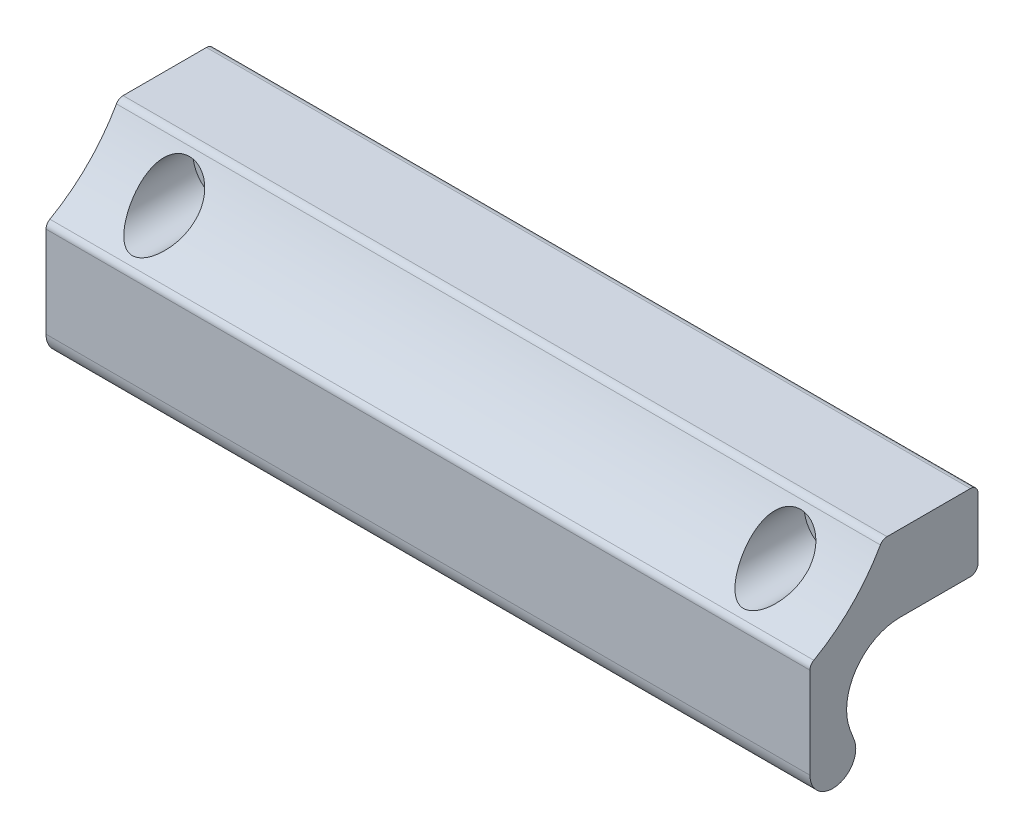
ISO-10303-21;
HEADER;
FILE_DESCRIPTION(('STEP AP214'),'2;1');
FILE_NAME('part.step','',(''),(''),'','','');
FILE_SCHEMA(('AUTOMOTIVE_DESIGN { 1 0 10303 214 1 1 1 1 }'));
ENDSEC;
DATA;
#1=APPLICATION_CONTEXT('core data for automotive mechanical design processes');
#2=APPLICATION_PROTOCOL_DEFINITION('international standard','automotive_design',2000,#1);
#3=PRODUCT_CONTEXT('',#1,'mechanical');
#4=PRODUCT('Part','Part','',(#3));
#5=PRODUCT_RELATED_PRODUCT_CATEGORY('part','',(#4));
#6=PRODUCT_DEFINITION_FORMATION('','',#4);
#7=PRODUCT_DEFINITION_CONTEXT('part definition',#1,'design');
#8=PRODUCT_DEFINITION('design','',#6,#7);
#9=PRODUCT_DEFINITION_SHAPE('','',#8);
#10=(LENGTH_UNIT() NAMED_UNIT(*) SI_UNIT(.MILLI.,.METRE.));
#11=(NAMED_UNIT(*) PLANE_ANGLE_UNIT() SI_UNIT($,.RADIAN.));
#12=(NAMED_UNIT(*) SI_UNIT($,.STERADIAN.) SOLID_ANGLE_UNIT());
#13=UNCERTAINTY_MEASURE_WITH_UNIT(LENGTH_MEASURE(1.E-05),#10,'distance_accuracy_value','');
#14=(GEOMETRIC_REPRESENTATION_CONTEXT(3) GLOBAL_UNCERTAINTY_ASSIGNED_CONTEXT((#13)) GLOBAL_UNIT_ASSIGNED_CONTEXT((#10,
#11,#12)) REPRESENTATION_CONTEXT('',''));
#15=CARTESIAN_POINT('',(0.,0.,0.));
#16=DIRECTION('',(0.,0.,1.));
#17=DIRECTION('',(1.,0.,0.));
#18=AXIS2_PLACEMENT_3D('',#15,#16,#17);
#19=CARTESIAN_POINT('',(-10.,15.8043402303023,32.8043402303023));
#20=DIRECTION('',(1.,0.,0.));
#21=DIRECTION('',(0.,1.,0.));
#22=AXIS2_PLACEMENT_3D('',#19,#20,#21);
#23=CYLINDRICAL_SURFACE('',#22,23.);
#24=CARTESIAN_POINT('',(83.75,0.,16.094378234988));
#25=CARTESIAN_POINT('',(83.7500006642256,-0.150169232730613,16.236409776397));
#26=CARTESIAN_POINT('',(83.7409857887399,-0.29845859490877,16.3805076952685));
#27=CARTESIAN_POINT('',(83.7061827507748,-0.590181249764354,16.6716960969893));
#28=CARTESIAN_POINT('',(83.6803814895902,-0.733610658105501,16.8187888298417));
#29=CARTESIAN_POINT('',(83.6128217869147,-1.01544237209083,17.1155863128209));
#30=CARTESIAN_POINT('',(83.5709823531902,-1.15381519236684,17.2653005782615));
#31=CARTESIAN_POINT('',(83.4720695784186,-1.42405592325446,17.5654707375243));
#32=CARTESIAN_POINT('',(83.4150003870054,-1.55592559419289,17.7159264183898));
#33=CARTESIAN_POINT('',(83.2849647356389,-1.81460439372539,18.0187712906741));
#34=CARTESIAN_POINT('',(83.2117670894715,-1.9413043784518,18.1711545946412));
#35=CARTESIAN_POINT('',(83.0498715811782,-2.1868769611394,18.4741574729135));
#36=CARTESIAN_POINT('',(82.9611662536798,-2.30574575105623,18.6247761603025));
#37=CARTESIAN_POINT('',(82.7681376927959,-2.53420019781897,18.9215160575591));
#38=CARTESIAN_POINT('',(82.6638971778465,-2.64383047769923,19.067656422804));
#39=CARTESIAN_POINT('',(82.4382918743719,-2.853229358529,19.3534526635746));
#40=CARTESIAN_POINT('',(82.316948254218,-2.95300989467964,19.493116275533));
#41=CARTESIAN_POINT('',(82.0789502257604,-3.12374564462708,19.7373761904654));
#42=CARTESIAN_POINT('',(81.965498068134,-3.19663498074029,19.8437139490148));
#43=CARTESIAN_POINT('',(81.7241156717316,-3.33304729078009,20.045999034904));
#44=CARTESIAN_POINT('',(81.5961684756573,-3.39655909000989,20.1419339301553));
#45=CARTESIAN_POINT('',(81.3222714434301,-3.51232726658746,20.3192407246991));
#46=CARTESIAN_POINT('',(81.1760841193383,-3.56440400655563,20.4003772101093));
#47=CARTESIAN_POINT('',(80.9451529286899,-3.62981593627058,20.5033135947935));
#48=CARTESIAN_POINT('',(80.8663403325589,-3.64948596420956,20.5344702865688));
#49=CARTESIAN_POINT('',(80.7051956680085,-3.68401760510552,20.5893923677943));
#50=CARTESIAN_POINT('',(80.6228662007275,-3.69888270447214,20.6131631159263));
#51=CARTESIAN_POINT('',(80.4293848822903,-3.72697994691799,20.658210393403));
#52=CARTESIAN_POINT('',(80.3172035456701,-3.73828046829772,20.6764343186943));
#53=CARTESIAN_POINT('',(80.0908651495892,-3.75060996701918,20.6963234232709));
#54=CARTESIAN_POINT('',(79.9767093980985,-3.75164550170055,20.6979991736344));
#55=CARTESIAN_POINT('',(79.7498794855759,-3.74336926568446,20.6846411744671));
#56=CARTESIAN_POINT('',(79.6372042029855,-3.73406584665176,20.669620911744));
#57=CARTESIAN_POINT('',(79.4161596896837,-3.70595298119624,20.6244737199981));
#58=CARTESIAN_POINT('',(79.307794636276,-3.68713454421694,20.5943325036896));
#59=CARTESIAN_POINT('',(79.0562251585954,-3.6323825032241,20.5072938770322));
#60=CARTESIAN_POINT('',(78.9158969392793,-3.59263719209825,20.4445472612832));
#61=CARTESIAN_POINT('',(78.6486494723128,-3.50092089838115,20.3017774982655));
#62=CARTESIAN_POINT('',(78.5217650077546,-3.44891927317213,20.2217110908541));
#63=CARTESIAN_POINT('',(78.303724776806,-3.34616134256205,20.0659999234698));
#64=CARTESIAN_POINT('',(78.2103375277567,-3.29701024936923,19.9923557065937));
#65=CARTESIAN_POINT('',(78.0314834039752,-3.19345122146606,19.839292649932));
#66=CARTESIAN_POINT('',(77.946021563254,-3.13903998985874,19.7598701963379));
#67=CARTESIAN_POINT('',(77.7823320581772,-3.0256203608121,19.5966727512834));
#68=CARTESIAN_POINT('',(77.704116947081,-2.96660430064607,19.5128905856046));
#69=CARTESIAN_POINT('',(77.554530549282,-2.84455534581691,19.3421814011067));
#70=CARTESIAN_POINT('',(77.4831614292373,-2.7815211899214,19.255253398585));
#71=CARTESIAN_POINT('',(77.3069800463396,-2.61388606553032,19.0275868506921));
#72=CARTESIAN_POINT('',(77.2070155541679,-2.50653247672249,18.8851063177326));
#73=CARTESIAN_POINT('',(77.022064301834,-2.28371602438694,18.5967547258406));
#74=CARTESIAN_POINT('',(76.9370856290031,-2.16824882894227,18.4508818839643));
#75=CARTESIAN_POINT('',(76.7815301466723,-1.92982538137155,18.1573214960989));
#76=CARTESIAN_POINT('',(76.710967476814,-1.80686192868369,18.0096323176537));
#77=CARTESIAN_POINT('',(76.5842889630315,-1.55415187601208,17.7139267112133));
#78=CARTESIAN_POINT('',(76.5281703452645,-1.42440658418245,17.565910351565));
#79=CARTESIAN_POINT('',(76.4294697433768,-1.15535678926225,17.2669625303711));
#80=CARTESIAN_POINT('',(76.3872582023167,-1.01589497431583,17.116049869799));
#81=CARTESIAN_POINT('',(76.3190319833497,-0.731044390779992,16.8160994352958));
#82=CARTESIAN_POINT('',(76.293019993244,-0.585654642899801,16.667061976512));
#83=CARTESIAN_POINT('',(76.25828003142,-0.290055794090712,16.3722410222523));
#84=CARTESIAN_POINT('',(76.2495221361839,-0.139855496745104,16.2264523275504));
#85=CARTESIAN_POINT('',(76.2505179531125,0.164377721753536,15.9391279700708));
#86=CARTESIAN_POINT('',(76.2602636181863,0.318408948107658,15.7975904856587));
#87=CARTESIAN_POINT('',(76.3079126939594,0.692581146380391,15.4630412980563));
#88=CARTESIAN_POINT('',(76.3557102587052,0.913971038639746,15.2726783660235));
#89=CARTESIAN_POINT('',(76.495799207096,1.35518812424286,14.9073062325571));
#90=CARTESIAN_POINT('',(76.588026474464,1.57501710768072,14.7322753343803));
#91=CARTESIAN_POINT('',(76.7991197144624,1.9636736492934,14.4335970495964));
#92=CARTESIAN_POINT('',(76.909662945,2.13429131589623,14.3064889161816));
#93=CARTESIAN_POINT('',(77.1001727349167,2.37997450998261,14.1282393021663));
#94=CARTESIAN_POINT('',(77.1678322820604,2.46019965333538,14.0708656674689));
#95=CARTESIAN_POINT('',(77.3113580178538,2.616281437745,13.9606622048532));
#96=CARTESIAN_POINT('',(77.3872204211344,2.69214006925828,13.907830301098));
#97=CARTESIAN_POINT('',(77.5477452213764,2.83917333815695,13.806643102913));
#98=CARTESIAN_POINT('',(77.6324832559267,2.91029755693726,13.758334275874));
#99=CARTESIAN_POINT('',(77.8097619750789,3.04594886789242,13.6672003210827));
#100=CARTESIAN_POINT('',(77.902298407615,3.11047951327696,13.6243722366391));
#101=CARTESIAN_POINT('',(78.0946077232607,3.23185755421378,13.5445905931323));
#102=CARTESIAN_POINT('',(78.1943773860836,3.2887083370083,13.5076344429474));
#103=CARTESIAN_POINT('',(78.4004020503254,3.39369189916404,13.4399472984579));
#104=CARTESIAN_POINT('',(78.5066557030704,3.44182648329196,13.4092150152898));
#105=CARTESIAN_POINT('',(78.7083226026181,3.52193401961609,13.3584049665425));
#106=CARTESIAN_POINT('',(78.8029778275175,3.55524764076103,13.3374209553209));
#107=CARTESIAN_POINT('',(78.9955300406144,3.61437106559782,13.3003439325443));
#108=CARTESIAN_POINT('',(79.0934265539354,3.64018196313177,13.2842502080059));
#109=CARTESIAN_POINT('',(79.2915997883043,3.68387839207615,13.2570880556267));
#110=CARTESIAN_POINT('',(79.3918751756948,3.70176825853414,13.2460168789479));
#111=CARTESIAN_POINT('',(79.5939747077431,3.72934871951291,13.2289770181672));
#112=CARTESIAN_POINT('',(79.6957987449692,3.73903988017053,13.2230079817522));
#113=CARTESIAN_POINT('',(79.8896006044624,3.74949905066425,13.2165676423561));
#114=CARTESIAN_POINT('',(79.9815192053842,3.751079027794,13.2155960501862));
#115=CARTESIAN_POINT('',(80.1652063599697,3.7474856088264,13.2178075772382));
#116=CARTESIAN_POINT('',(80.2569748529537,3.74230994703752,13.2209920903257));
#117=CARTESIAN_POINT('',(80.4395972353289,3.72527248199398,13.2314961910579));
#118=CARTESIAN_POINT('',(80.5304516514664,3.71341478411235,13.2388132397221));
#119=CARTESIAN_POINT('',(80.7106535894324,3.68318293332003,13.2575283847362));
#120=CARTESIAN_POINT('',(80.8000005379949,3.66480635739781,13.2689279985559));
#121=CARTESIAN_POINT('',(81.0615737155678,3.60101108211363,13.3086664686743));
#122=CARTESIAN_POINT('',(81.2308516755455,3.54658365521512,13.3427515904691));
#123=CARTESIAN_POINT('',(81.5568664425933,3.41607587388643,13.4255677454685));
#124=CARTESIAN_POINT('',(81.7136012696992,3.33999210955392,13.4743010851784));
#125=CARTESIAN_POINT('',(82.0192314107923,3.1650856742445,13.5881842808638));
#126=CARTESIAN_POINT('',(82.1672994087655,3.0652888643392,13.6540540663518));
#127=CARTESIAN_POINT('',(82.443829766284,2.84973334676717,13.7992083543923));
#128=CARTESIAN_POINT('',(82.5722875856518,2.73397095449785,13.8784959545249));
#129=CARTESIAN_POINT('',(82.8221710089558,2.47661423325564,14.0586987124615));
#130=CARTESIAN_POINT('',(82.9410681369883,2.33358067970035,14.1610543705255));
#131=CARTESIAN_POINT('',(83.1530779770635,2.03807613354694,14.3781704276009));
#132=CARTESIAN_POINT('',(83.2461621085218,1.8855949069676,14.4929443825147));
#133=CARTESIAN_POINT('',(83.4441188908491,1.50504726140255,14.7873723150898));
#134=CARTESIAN_POINT('',(83.5350714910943,1.27416834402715,14.9727785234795));
#135=CARTESIAN_POINT('',(83.668890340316,0.81220025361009,15.3593785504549));
#136=CARTESIAN_POINT('',(83.7117581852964,0.581111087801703,15.5605718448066));
#137=CARTESIAN_POINT('',(83.7389347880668,0.293978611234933,15.8209607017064));
#138=CARTESIAN_POINT('',(83.7431071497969,0.234797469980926,15.8751995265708));
#139=CARTESIAN_POINT('',(83.7486383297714,0.116983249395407,15.9843147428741));
#140=CARTESIAN_POINT('',(83.7499997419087,0.0583497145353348,16.0391904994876));
#141=CARTESIAN_POINT('',(83.75,0.,16.094378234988));
#142=B_SPLINE_CURVE_WITH_KNOTS('',3,(#24,#25,#26,#27,#28,#29,#30,#31,#32,#33,#34,#35,#36,#37,
#38,#39,#40,#41,#42,#43,#44,#45,#46,#47,#48,#49,#50,#51,#52,#53,#54,#55,#56,#57,#58,#59,#60,#61,
#62,#63,#64,#65,#66,#67,#68,#69,#70,#71,#72,#73,#74,#75,#76,#77,#78,#79,#80,#81,#82,#83,#84,#85,
#86,#87,#88,#89,#90,#91,#92,#93,#94,#95,#96,#97,#98,#99,#100,#101,#102,#103,#104,#105,#106,#107,
#108,#109,#110,#111,#112,#113,#114,#115,#116,#117,#118,#119,#120,#121,#122,#123,#124,#125,#126,
#127,#128,#129,#130,#131,#132,#133,#134,#135,#136,#137,#138,#139,#140,#141),.UNSPECIFIED.,.T.,
.F.,(4,2,2,2,2,2,2,2,2,2,2,2,2,2,2,2,2,2,2,2,2,2,2,2,2,2,2,2,2,2,2,2,2,2,2,2,2,2,2,2,2,2,2,2,2,
2,2,2,2,2,2,2,2,2,2,2,2,2,4),(0.,0.620002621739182,1.24048962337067,1.8641522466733,
2.48764511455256,3.12073548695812,3.75413147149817,4.38426801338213,5.01363137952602,
5.52787354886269,6.04272365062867,6.5651600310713,6.82572511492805,7.08610070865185,
7.4271175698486,7.76791657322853,8.108440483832,8.44928675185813,8.92293422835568,
9.39777869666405,9.78331644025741,10.1690974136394,10.5555346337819,10.9420937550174,
11.5546950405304,12.1676259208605,12.781155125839,13.3945664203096,14.0231985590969,
14.6519349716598,15.2795800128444,15.9069521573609,16.7911651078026,17.6741058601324,
18.3902630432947,18.7487042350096,19.1069807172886,19.4686065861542,19.8300365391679,
20.1913065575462,20.5525016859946,20.859631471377,21.1667164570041,21.4736331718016,
21.7805286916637,22.056004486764,22.3315726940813,22.606971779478,22.8824733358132,
23.422984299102,23.9635804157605,24.532194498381,25.100940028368,25.7354158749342,
26.370591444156,27.2948858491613,28.2191495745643,28.4602802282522,28.7011882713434),.UNSPECIFIED.);
#143=CARTESIAN_POINT('',(83.75,0.,16.094378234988));
#144=VERTEX_POINT('',#143);
#145=EDGE_CURVE('E18',#144,#144,#142,.T.);
#146=ORIENTED_EDGE('',*,*,#145,.T.);
#147=EDGE_LOOP('',(#146));
#148=FACE_BOUND('',#147,.T.);
#149=CARTESIAN_POINT('',(3.75,0.,16.094378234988));
#150=CARTESIAN_POINT('',(3.75000066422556,-0.150169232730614,16.236409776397));
#151=CARTESIAN_POINT('',(3.74098578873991,-0.298458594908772,16.3805076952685));
#152=CARTESIAN_POINT('',(3.70618275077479,-0.590181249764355,16.6716960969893));
#153=CARTESIAN_POINT('',(3.68038148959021,-0.7336106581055,16.8187888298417));
#154=CARTESIAN_POINT('',(3.61282178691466,-1.01544237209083,17.1155863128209));
#155=CARTESIAN_POINT('',(3.57098235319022,-1.15381519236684,17.2653005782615));
#156=CARTESIAN_POINT('',(3.47206957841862,-1.42405592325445,17.5654707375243));
#157=CARTESIAN_POINT('',(3.41500038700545,-1.55592559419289,17.7159264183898));
#158=CARTESIAN_POINT('',(3.28496473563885,-1.81460439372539,18.0187712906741));
#159=CARTESIAN_POINT('',(3.21176708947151,-1.9413043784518,18.1711545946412));
#160=CARTESIAN_POINT('',(3.04987158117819,-2.1868769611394,18.4741574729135));
#161=CARTESIAN_POINT('',(2.96116625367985,-2.30574575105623,18.6247761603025));
#162=CARTESIAN_POINT('',(2.76813769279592,-2.53420019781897,18.9215160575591));
#163=CARTESIAN_POINT('',(2.66389717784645,-2.64383047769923,19.067656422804));
#164=CARTESIAN_POINT('',(2.43829187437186,-2.853229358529,19.3534526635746));
#165=CARTESIAN_POINT('',(2.31694825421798,-2.95300989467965,19.493116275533));
#166=CARTESIAN_POINT('',(2.07895022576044,-3.12374564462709,19.7373761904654));
#167=CARTESIAN_POINT('',(1.965498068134,-3.19663498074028,19.8437139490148));
#168=CARTESIAN_POINT('',(1.72411567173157,-3.33304729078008,20.045999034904));
#169=CARTESIAN_POINT('',(1.59616847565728,-3.3965590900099,20.1419339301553));
#170=CARTESIAN_POINT('',(1.32227144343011,-3.51232726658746,20.3192407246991));
#171=CARTESIAN_POINT('',(1.1760841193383,-3.56440400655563,20.4003772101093));
#172=CARTESIAN_POINT('',(0.945152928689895,-3.62981593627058,20.5033135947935));
#173=CARTESIAN_POINT('',(0.866340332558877,-3.64948596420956,20.5344702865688));
#174=CARTESIAN_POINT('',(0.705195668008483,-3.68401760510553,20.5893923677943));
#175=CARTESIAN_POINT('',(0.622866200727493,-3.69888270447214,20.6131631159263));
#176=CARTESIAN_POINT('',(0.429384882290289,-3.72697994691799,20.658210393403));
#177=CARTESIAN_POINT('',(0.317203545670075,-3.73828046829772,20.6764343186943));
#178=CARTESIAN_POINT('',(0.090865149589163,-3.75060996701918,20.6963234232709));
#179=CARTESIAN_POINT('',(-0.0232906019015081,-3.75164550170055,20.6979991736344));
#180=CARTESIAN_POINT('',(-0.250120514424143,-3.74336926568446,20.6846411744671));
#181=CARTESIAN_POINT('',(-0.362795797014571,-3.73406584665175,20.669620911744));
#182=CARTESIAN_POINT('',(-0.583840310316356,-3.70595298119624,20.6244737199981));
#183=CARTESIAN_POINT('',(-0.692205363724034,-3.68713454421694,20.5943325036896));
#184=CARTESIAN_POINT('',(-0.943774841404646,-3.63238250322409,20.5072938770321));
#185=CARTESIAN_POINT('',(-1.0841030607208,-3.59263719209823,20.4445472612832));
#186=CARTESIAN_POINT('',(-1.35135052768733,-3.50092089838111,20.3017774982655));
#187=CARTESIAN_POINT('',(-1.47823499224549,-3.44891927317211,20.221711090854));
#188=CARTESIAN_POINT('',(-1.6962752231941,-3.34616134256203,20.0659999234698));
#189=CARTESIAN_POINT('',(-1.7896624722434,-3.29701024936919,19.9923557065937));
#190=CARTESIAN_POINT('',(-1.9685165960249,-3.19345122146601,19.839292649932));
#191=CARTESIAN_POINT('',(-2.0539784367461,-3.1390399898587,19.7598701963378));
#192=CARTESIAN_POINT('',(-2.2176679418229,-3.02562036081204,19.5966727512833));
#193=CARTESIAN_POINT('',(-2.29588305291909,-2.96660430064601,19.5128905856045));
#194=CARTESIAN_POINT('',(-2.44546945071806,-2.84455534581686,19.3421814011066));
#195=CARTESIAN_POINT('',(-2.51683857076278,-2.78152118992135,19.255253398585));
#196=CARTESIAN_POINT('',(-2.69301995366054,-2.61388606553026,19.0275868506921));
#197=CARTESIAN_POINT('',(-2.79298444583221,-2.50653247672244,18.8851063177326));
#198=CARTESIAN_POINT('',(-2.97793569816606,-2.28371602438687,18.5967547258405));
#199=CARTESIAN_POINT('',(-3.06291437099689,-2.16824882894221,18.4508818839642));
#200=CARTESIAN_POINT('',(-3.21846985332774,-1.92982538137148,18.1573214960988));
#201=CARTESIAN_POINT('',(-3.28903252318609,-1.80686192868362,18.0096323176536));
#202=CARTESIAN_POINT('',(-3.41571103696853,-1.554151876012,17.7139267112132));
#203=CARTESIAN_POINT('',(-3.47182965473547,-1.42440658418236,17.5659103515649));
#204=CARTESIAN_POINT('',(-3.57053025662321,-1.15535678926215,17.266962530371));
#205=CARTESIAN_POINT('',(-3.61274179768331,-1.01589497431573,17.1160498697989));
#206=CARTESIAN_POINT('',(-3.68096801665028,-0.731044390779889,16.8160994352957));
#207=CARTESIAN_POINT('',(-3.70698000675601,-0.585654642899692,16.6670619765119));
#208=CARTESIAN_POINT('',(-3.74171996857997,-0.290055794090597,16.3722410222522));
#209=CARTESIAN_POINT('',(-3.75047786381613,-0.13985549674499,16.2264523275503));
#210=CARTESIAN_POINT('',(-3.74948204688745,0.164377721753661,15.9391279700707));
#211=CARTESIAN_POINT('',(-3.73973638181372,0.318408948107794,15.7975904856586));
#212=CARTESIAN_POINT('',(-3.69208730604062,0.692581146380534,15.4630412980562));
#213=CARTESIAN_POINT('',(-3.64428974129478,0.913971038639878,15.2726783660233));
#214=CARTESIAN_POINT('',(-3.50420079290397,1.35518812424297,14.907306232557));
#215=CARTESIAN_POINT('',(-3.41197352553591,1.57501710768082,14.7322753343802));
#216=CARTESIAN_POINT('',(-3.20088028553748,1.9636736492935,14.4335970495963));
#217=CARTESIAN_POINT('',(-3.09033705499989,2.13429131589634,14.3064889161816));
#218=CARTESIAN_POINT('',(-2.89982726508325,2.3799745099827,14.1282393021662));
#219=CARTESIAN_POINT('',(-2.83216771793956,2.46019965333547,14.0708656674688));
#220=CARTESIAN_POINT('',(-2.68864198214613,2.61628143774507,13.9606622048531));
#221=CARTESIAN_POINT('',(-2.61277957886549,2.69214006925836,13.9078303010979));
#222=CARTESIAN_POINT('',(-2.45225477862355,2.83917333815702,13.806643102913));
#223=CARTESIAN_POINT('',(-2.36751674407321,2.91029755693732,13.758334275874));
#224=CARTESIAN_POINT('',(-2.19023802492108,3.04594886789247,13.6672003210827));
#225=CARTESIAN_POINT('',(-2.09770159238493,3.11047951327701,13.624372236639));
#226=CARTESIAN_POINT('',(-1.90539227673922,3.23185755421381,13.5445905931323));
#227=CARTESIAN_POINT('',(-1.80562261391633,3.28870833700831,13.5076344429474));
#228=CARTESIAN_POINT('',(-1.59959794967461,3.39369189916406,13.4399472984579));
#229=CARTESIAN_POINT('',(-1.49334429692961,3.44182648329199,13.4092150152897));
#230=CARTESIAN_POINT('',(-1.29167739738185,3.52193401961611,13.3584049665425));
#231=CARTESIAN_POINT('',(-1.19702217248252,3.55524764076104,13.3374209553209));
#232=CARTESIAN_POINT('',(-1.00446995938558,3.61437106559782,13.3003439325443));
#233=CARTESIAN_POINT('',(-0.906573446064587,3.64018196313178,13.2842502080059));
#234=CARTESIAN_POINT('',(-0.708400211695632,3.68387839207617,13.2570880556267));
#235=CARTESIAN_POINT('',(-0.608124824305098,3.70176825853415,13.2460168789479));
#236=CARTESIAN_POINT('',(-0.4060252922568,3.72934871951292,13.2289770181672));
#237=CARTESIAN_POINT('',(-0.304201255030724,3.73903988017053,13.2230079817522));
#238=CARTESIAN_POINT('',(-0.110399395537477,3.74949905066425,13.2165676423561));
#239=CARTESIAN_POINT('',(-0.0184807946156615,3.751079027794,13.2155960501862));
#240=CARTESIAN_POINT('',(0.165206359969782,3.74748560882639,13.2178075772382));
#241=CARTESIAN_POINT('',(0.256974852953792,3.74230994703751,13.2209920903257));
#242=CARTESIAN_POINT('',(0.439597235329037,3.72527248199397,13.2314961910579));
#243=CARTESIAN_POINT('',(0.530451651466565,3.71341478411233,13.2388132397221));
#244=CARTESIAN_POINT('',(0.710653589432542,3.68318293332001,13.2575283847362));
#245=CARTESIAN_POINT('',(0.800000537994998,3.66480635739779,13.2689279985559));
#246=CARTESIAN_POINT('',(1.06157371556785,3.60101108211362,13.3086664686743));
#247=CARTESIAN_POINT('',(1.23085167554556,3.54658365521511,13.3427515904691));
#248=CARTESIAN_POINT('',(1.55686644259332,3.4160758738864,13.4255677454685));
#249=CARTESIAN_POINT('',(1.7136012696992,3.33999210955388,13.4743010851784));
#250=CARTESIAN_POINT('',(2.01923141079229,3.16508567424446,13.5881842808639));
#251=CARTESIAN_POINT('',(2.16729940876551,3.06528886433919,13.6540540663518));
#252=CARTESIAN_POINT('',(2.44382976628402,2.84973334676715,13.7992083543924));
#253=CARTESIAN_POINT('',(2.57228758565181,2.7339709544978,13.878495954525));
#254=CARTESIAN_POINT('',(2.82217100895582,2.47661423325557,14.0586987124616));
#255=CARTESIAN_POINT('',(2.94106813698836,2.3335806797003,14.1610543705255));
#256=CARTESIAN_POINT('',(3.15307797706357,2.03807613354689,14.378170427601));
#257=CARTESIAN_POINT('',(3.24616210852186,1.88559490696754,14.4929443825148));
#258=CARTESIAN_POINT('',(3.44411889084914,1.50504726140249,14.7873723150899));
#259=CARTESIAN_POINT('',(3.53507149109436,1.27416834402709,14.9727785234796));
#260=CARTESIAN_POINT('',(3.66889034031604,0.812200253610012,15.3593785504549));
#261=CARTESIAN_POINT('',(3.71175818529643,0.581111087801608,15.5605718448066));
#262=CARTESIAN_POINT('',(3.73893478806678,0.293978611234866,15.8209607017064));
#263=CARTESIAN_POINT('',(3.74310714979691,0.234797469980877,15.8751995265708));
#264=CARTESIAN_POINT('',(3.74863832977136,0.116983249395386,15.9843147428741));
#265=CARTESIAN_POINT('',(3.7499997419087,0.0583497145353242,16.0391904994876));
#266=CARTESIAN_POINT('',(3.75,0.,16.094378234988));
#267=B_SPLINE_CURVE_WITH_KNOTS('',3,(#149,#150,#151,#152,#153,#154,#155,#156,#157,#158,#159,
#160,#161,#162,#163,#164,#165,#166,#167,#168,#169,#170,#171,#172,#173,#174,#175,#176,#177,#178,
#179,#180,#181,#182,#183,#184,#185,#186,#187,#188,#189,#190,#191,#192,#193,#194,#195,#196,#197,
#198,#199,#200,#201,#202,#203,#204,#205,#206,#207,#208,#209,#210,#211,#212,#213,#214,#215,#216,
#217,#218,#219,#220,#221,#222,#223,#224,#225,#226,#227,#228,#229,#230,#231,#232,#233,#234,#235,
#236,#237,#238,#239,#240,#241,#242,#243,#244,#245,#246,#247,#248,#249,#250,#251,#252,#253,#254,
#255,#256,#257,#258,#259,#260,#261,#262,#263,#264,#265,#266),.UNSPECIFIED.,.T.,.F.,(4,2,2,2,2,2,
2,2,2,2,2,2,2,2,2,2,2,2,2,2,2,2,2,2,2,2,2,2,2,2,2,2,2,2,2,2,2,2,2,2,2,2,2,2,2,2,2,2,2,2,2,2,2,2,
2,2,2,2,4),(0.,0.62000262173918,1.24048962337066,1.8641522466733,2.48764511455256,
3.12073548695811,3.75413147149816,4.38426801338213,5.01363137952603,5.52787354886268,
6.04272365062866,6.5651600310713,6.82572511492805,7.08610070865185,7.42711756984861,
7.76791657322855,8.10844048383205,8.44928675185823,8.92293422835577,9.39777869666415,
9.78331644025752,10.1690974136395,10.555534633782,10.9420937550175,11.5546950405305,
12.1676259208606,12.7811551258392,13.3945664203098,14.0231985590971,14.65193497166,
15.2795800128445,15.9069521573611,16.7911651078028,17.6741058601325,18.3902630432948,
18.7487042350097,19.1069807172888,19.4686065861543,19.830036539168,20.1913065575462,
20.5525016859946,20.859631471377,21.1667164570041,21.4736331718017,21.7805286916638,
22.0560044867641,22.3315726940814,22.6069717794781,22.8824733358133,23.4229842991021,
23.9635804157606,24.532194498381,25.1009400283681,25.7354158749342,26.3705914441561,
27.2948858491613,28.2191495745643,28.4602802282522,28.7011882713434),.UNSPECIFIED.);
#268=CARTESIAN_POINT('',(3.75,0.,16.094378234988));
#269=VERTEX_POINT('',#268);
#270=EDGE_CURVE('E131',#269,#269,#267,.T.);
#271=ORIENTED_EDGE('',*,*,#270,.T.);
#272=EDGE_LOOP('',(#271));
#273=FACE_BOUND('',#272,.T.);
#274=DIRECTION('',(1.,0.,0.));
#275=VECTOR('',#274,1.);
#276=CARTESIAN_POINT('',(-10.,-4.22133100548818,21.4918475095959));
#277=LINE('',#276,#275);
#278=CARTESIAN_POINT('',(-10.,-4.22133100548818,21.4918475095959));
#279=VERTEX_POINT('',#278);
#280=CARTESIAN_POINT('',(90.,-4.22133100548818,21.4918475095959));
#281=VERTEX_POINT('',#280);
#282=EDGE_CURVE('E127',#279,#281,#277,.T.);
#283=ORIENTED_EDGE('',*,*,#282,.T.);
#284=CARTESIAN_POINT('',(90.,15.8043402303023,32.8043402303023));
#285=DIRECTION('',(1.,0.,0.));
#286=DIRECTION('',(0.,-1.,0.));
#287=AXIS2_PLACEMENT_3D('',#284,#285,#286);
#288=CIRCLE('',#287,23.);
#289=CARTESIAN_POINT('',(90.,4.49184750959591,12.7786689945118));
#290=VERTEX_POINT('',#289);
#291=EDGE_CURVE('E121',#281,#290,#288,.T.);
#292=ORIENTED_EDGE('',*,*,#291,.T.);
#293=DIRECTION('',(1.,0.,0.));
#294=VECTOR('',#293,1.);
#295=CARTESIAN_POINT('',(-10.,4.49184750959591,12.7786689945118));
#296=LINE('',#295,#294);
#297=CARTESIAN_POINT('',(-10.,4.49184750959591,12.7786689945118));
#298=VERTEX_POINT('',#297);
#299=EDGE_CURVE('E9',#298,#290,#296,.T.);
#300=ORIENTED_EDGE('',*,*,#299,.F.);
#301=CARTESIAN_POINT('',(-10.,15.8043402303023,32.8043402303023));
#302=DIRECTION('',(1.,0.,0.));
#303=DIRECTION('',(0.,-1.,0.));
#304=AXIS2_PLACEMENT_3D('',#301,#302,#303);
#305=CIRCLE('',#304,23.);
#306=EDGE_CURVE('E162',#279,#298,#305,.T.);
#307=ORIENTED_EDGE('',*,*,#306,.F.);
#308=EDGE_LOOP('',(#283,#292,#300,#307));
#309=FACE_BOUND('',#308,.T.);
#310=ADVANCED_FACE('F14',(#148,#273,#309),#23,.F.);
#311=CARTESIAN_POINT('',(-10.,4.,11.907987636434));
#312=DIRECTION('',(1.,0.,0.));
#313=DIRECTION('',(0.,1.,0.));
#314=AXIS2_PLACEMENT_3D('',#311,#312,#313);
#315=CYLINDRICAL_SURFACE('',#314,1.);
#316=ORIENTED_EDGE('',*,*,#299,.T.);
#317=CARTESIAN_POINT('',(90.,4.,11.907987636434));
#318=DIRECTION('',(-1.,0.,0.));
#319=DIRECTION('',(0.,-1.,0.));
#320=AXIS2_PLACEMENT_3D('',#317,#318,#319);
#321=CIRCLE('',#320,1.);
#322=CARTESIAN_POINT('',(90.,5.,11.907987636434));
#323=VERTEX_POINT('',#322);
#324=EDGE_CURVE('E111',#290,#323,#321,.T.);
#325=ORIENTED_EDGE('',*,*,#324,.T.);
#326=DIRECTION('',(1.,0.,0.));
#327=VECTOR('',#326,1.);
#328=CARTESIAN_POINT('',(-10.,5.,11.907987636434));
#329=LINE('',#328,#327);
#330=CARTESIAN_POINT('',(-10.,5.,11.907987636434));
#331=VERTEX_POINT('',#330);
#332=EDGE_CURVE('E27',#331,#323,#329,.T.);
#333=ORIENTED_EDGE('',*,*,#332,.F.);
#334=CARTESIAN_POINT('',(-10.,4.,11.907987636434));
#335=DIRECTION('',(-1.,0.,0.));
#336=DIRECTION('',(0.,-1.,0.));
#337=AXIS2_PLACEMENT_3D('',#334,#335,#336);
#338=CIRCLE('',#337,1.);
#339=EDGE_CURVE('E112',#298,#331,#338,.T.);
#340=ORIENTED_EDGE('',*,*,#339,.F.);
#341=EDGE_LOOP('',(#316,#325,#333,#340));
#342=FACE_BOUND('',#341,.T.);
#343=ADVANCED_FACE('F109',(#342),#315,.T.);
#344=CARTESIAN_POINT('',(-10.,5.,11.907987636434));
#345=DIRECTION('',(0.,-1.,0.));
#346=DIRECTION('',(1.,0.,0.));
#347=AXIS2_PLACEMENT_3D('',#344,#345,#346);
#348=PLANE('',#347);
#349=ORIENTED_EDGE('',*,*,#332,.T.);
#350=DIRECTION('',(0.,0.,-1.));
#351=VECTOR('',#350,1.);
#352=CARTESIAN_POINT('',(90.,5.,11.907987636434));
#353=LINE('',#352,#351);
#354=CARTESIAN_POINT('',(90.,5.,1.));
#355=VERTEX_POINT('',#354);
#356=EDGE_CURVE('E125',#323,#355,#353,.T.);
#357=ORIENTED_EDGE('',*,*,#356,.T.);
#358=DIRECTION('',(1.,0.,0.));
#359=VECTOR('',#358,1.);
#360=CARTESIAN_POINT('',(-10.,5.,1.));
#361=LINE('',#360,#359);
#362=CARTESIAN_POINT('',(-10.,5.,1.));
#363=VERTEX_POINT('',#362);
#364=EDGE_CURVE('E200',#363,#355,#361,.T.);
#365=ORIENTED_EDGE('',*,*,#364,.F.);
#366=DIRECTION('',(0.,0.,-1.));
#367=VECTOR('',#366,1.);
#368=CARTESIAN_POINT('',(-10.,5.,11.907987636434));
#369=LINE('',#368,#367);
#370=EDGE_CURVE('E165',#331,#363,#369,.T.);
#371=ORIENTED_EDGE('',*,*,#370,.F.);
#372=EDGE_LOOP('',(#349,#357,#365,#371));
#373=FACE_BOUND('',#372,.T.);
#374=ADVANCED_FACE('F265',(#373),#348,.F.);
#375=CARTESIAN_POINT('',(-10.,4.,1.));
#376=DIRECTION('',(1.,0.,0.));
#377=DIRECTION('',(0.,1.,0.));
#378=AXIS2_PLACEMENT_3D('',#375,#376,#377);
#379=CYLINDRICAL_SURFACE('',#378,1.);
#380=ORIENTED_EDGE('',*,*,#364,.T.);
#381=CARTESIAN_POINT('',(90.,4.,1.));
#382=DIRECTION('',(-1.,0.,0.));
#383=DIRECTION('',(0.,-1.,0.));
#384=AXIS2_PLACEMENT_3D('',#381,#382,#383);
#385=CIRCLE('',#384,1.);
#386=CARTESIAN_POINT('',(90.,4.,0.));
#387=VERTEX_POINT('',#386);
#388=EDGE_CURVE('E136',#355,#387,#385,.T.);
#389=ORIENTED_EDGE('',*,*,#388,.T.);
#390=DIRECTION('',(1.,0.,0.));
#391=VECTOR('',#390,1.);
#392=CARTESIAN_POINT('',(-10.,4.,0.));
#393=LINE('',#392,#391);
#394=CARTESIAN_POINT('',(-10.,4.,0.));
#395=VERTEX_POINT('',#394);
#396=EDGE_CURVE('E198',#395,#387,#393,.T.);
#397=ORIENTED_EDGE('',*,*,#396,.F.);
#398=CARTESIAN_POINT('',(-10.,4.,1.));
#399=DIRECTION('',(-1.,0.,0.));
#400=DIRECTION('',(0.,-1.,0.));
#401=AXIS2_PLACEMENT_3D('',#398,#399,#400);
#402=CIRCLE('',#401,1.);
#403=EDGE_CURVE('E167',#363,#395,#402,.T.);
#404=ORIENTED_EDGE('',*,*,#403,.F.);
#405=EDGE_LOOP('',(#380,#389,#397,#404));
#406=FACE_BOUND('',#405,.T.);
#407=ADVANCED_FACE('F261',(#406),#379,.T.);
#408=CARTESIAN_POINT('',(-10.,4.,0.));
#409=DIRECTION('',(0.,0.,1.));
#410=DIRECTION('',(-1.,0.,0.));
#411=AXIS2_PLACEMENT_3D('',#408,#409,#410);
#412=PLANE('',#411);
#413=CARTESIAN_POINT('',(80.,0.,0.));
#414=DIRECTION('',(0.,0.,-1.));
#415=DIRECTION('',(1.,0.,0.));
#416=AXIS2_PLACEMENT_3D('',#413,#414,#415);
#417=CIRCLE('',#416,2.25);
#418=CARTESIAN_POINT('',(82.25,0.,0.));
#419=VERTEX_POINT('',#418);
#420=EDGE_CURVE('E285',#419,#419,#417,.T.);
#421=ORIENTED_EDGE('',*,*,#420,.F.);
#422=EDGE_LOOP('',(#421));
#423=FACE_BOUND('',#422,.T.);
#424=CARTESIAN_POINT('',(0.,0.,0.));
#425=DIRECTION('',(0.,0.,-1.));
#426=DIRECTION('',(1.,0.,0.));
#427=AXIS2_PLACEMENT_3D('',#424,#425,#426);
#428=CIRCLE('',#427,2.25);
#429=CARTESIAN_POINT('',(2.25,0.,0.));
#430=VERTEX_POINT('',#429);
#431=EDGE_CURVE('E128',#430,#430,#428,.T.);
#432=ORIENTED_EDGE('',*,*,#431,.F.);
#433=EDGE_LOOP('',(#432));
#434=FACE_BOUND('',#433,.T.);
#435=ORIENTED_EDGE('',*,*,#396,.T.);
#436=DIRECTION('',(0.,-1.,0.));
#437=VECTOR('',#436,1.);
#438=CARTESIAN_POINT('',(90.,4.,0.));
#439=LINE('',#438,#437);
#440=CARTESIAN_POINT('',(90.,-4.,0.));
#441=VERTEX_POINT('',#440);
#442=EDGE_CURVE('E139',#387,#441,#439,.T.);
#443=ORIENTED_EDGE('',*,*,#442,.T.);
#444=DIRECTION('',(1.,0.,0.));
#445=VECTOR('',#444,1.);
#446=CARTESIAN_POINT('',(-10.,-4.,0.));
#447=LINE('',#446,#445);
#448=CARTESIAN_POINT('',(-10.,-4.,0.));
#449=VERTEX_POINT('',#448);
#450=EDGE_CURVE('E196',#449,#441,#447,.T.);
#451=ORIENTED_EDGE('',*,*,#450,.F.);
#452=DIRECTION('',(0.,-1.,0.));
#453=VECTOR('',#452,1.);
#454=CARTESIAN_POINT('',(-10.,4.,0.));
#455=LINE('',#454,#453);
#456=EDGE_CURVE('E169',#395,#449,#455,.T.);
#457=ORIENTED_EDGE('',*,*,#456,.F.);
#458=EDGE_LOOP('',(#435,#443,#451,#457));
#459=FACE_BOUND('',#458,.T.);
#460=ADVANCED_FACE('F257',(#423,#434,#459),#412,.F.);
#461=CARTESIAN_POINT('',(-10.,-4.,1.));
#462=DIRECTION('',(1.,0.,0.));
#463=DIRECTION('',(0.,1.,0.));
#464=AXIS2_PLACEMENT_3D('',#461,#462,#463);
#465=CYLINDRICAL_SURFACE('',#464,1.);
#466=ORIENTED_EDGE('',*,*,#450,.T.);
#467=CARTESIAN_POINT('',(90.,-4.,1.));
#468=DIRECTION('',(-1.,0.,0.));
#469=DIRECTION('',(0.,-1.,0.));
#470=AXIS2_PLACEMENT_3D('',#467,#468,#469);
#471=CIRCLE('',#470,1.);
#472=CARTESIAN_POINT('',(90.,-5.,1.));
#473=VERTEX_POINT('',#472);
#474=EDGE_CURVE('E142',#441,#473,#471,.T.);
#475=ORIENTED_EDGE('',*,*,#474,.T.);
#476=DIRECTION('',(1.,0.,0.));
#477=VECTOR('',#476,1.);
#478=CARTESIAN_POINT('',(-10.,-5.,1.));
#479=LINE('',#478,#477);
#480=CARTESIAN_POINT('',(-10.,-5.,1.));
#481=VERTEX_POINT('',#480);
#482=EDGE_CURVE('E194',#481,#473,#479,.T.);
#483=ORIENTED_EDGE('',*,*,#482,.F.);
#484=CARTESIAN_POINT('',(-10.,-4.,1.));
#485=DIRECTION('',(-1.,0.,0.));
#486=DIRECTION('',(0.,-1.,0.));
#487=AXIS2_PLACEMENT_3D('',#484,#485,#486);
#488=CIRCLE('',#487,1.);
#489=EDGE_CURVE('E171',#449,#481,#488,.T.);
#490=ORIENTED_EDGE('',*,*,#489,.F.);
#491=EDGE_LOOP('',(#466,#475,#483,#490));
#492=FACE_BOUND('',#491,.T.);
#493=ADVANCED_FACE('F253',(#492),#465,.T.);
#494=CARTESIAN_POINT('',(-10.,-5.,1.));
#495=DIRECTION('',(0.,1.,0.));
#496=DIRECTION('',(-1.,0.,0.));
#497=AXIS2_PLACEMENT_3D('',#494,#495,#496);
#498=PLANE('',#497);
#499=ORIENTED_EDGE('',*,*,#482,.T.);
#500=DIRECTION('',(0.,0.,1.));
#501=VECTOR('',#500,1.);
#502=CARTESIAN_POINT('',(90.,-5.,1.));
#503=LINE('',#502,#501);
#504=CARTESIAN_POINT('',(90.,-5.,10.2));
#505=VERTEX_POINT('',#504);
#506=EDGE_CURVE('E145',#473,#505,#503,.T.);
#507=ORIENTED_EDGE('',*,*,#506,.T.);
#508=DIRECTION('',(1.,0.,0.));
#509=VECTOR('',#508,1.);
#510=CARTESIAN_POINT('',(-10.,-5.,10.2));
#511=LINE('',#510,#509);
#512=CARTESIAN_POINT('',(-10.,-5.,10.2));
#513=VERTEX_POINT('',#512);
#514=EDGE_CURVE('E192',#513,#505,#511,.T.);
#515=ORIENTED_EDGE('',*,*,#514,.F.);
#516=DIRECTION('',(0.,0.,1.));
#517=VECTOR('',#516,1.);
#518=CARTESIAN_POINT('',(-10.,-5.,1.));
#519=LINE('',#518,#517);
#520=EDGE_CURVE('E173',#481,#513,#519,.T.);
#521=ORIENTED_EDGE('',*,*,#520,.F.);
#522=EDGE_LOOP('',(#499,#507,#515,#521));
#523=FACE_BOUND('',#522,.T.);
#524=ADVANCED_FACE('F249',(#523),#498,.F.);
#525=CARTESIAN_POINT('',(-10.,-12.,10.2));
#526=DIRECTION('',(1.,0.,0.));
#527=DIRECTION('',(0.,1.,0.));
#528=AXIS2_PLACEMENT_3D('',#525,#526,#527);
#529=CYLINDRICAL_SURFACE('',#528,7.);
#530=ORIENTED_EDGE('',*,*,#514,.T.);
#531=CARTESIAN_POINT('',(90.,-12.,10.2));
#532=DIRECTION('',(1.,0.,0.));
#533=DIRECTION('',(0.,-1.,0.));
#534=AXIS2_PLACEMENT_3D('',#531,#532,#533);
#535=CIRCLE('',#534,7.);
#536=CARTESIAN_POINT('',(90.,-14.4773303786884,16.7469713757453));
#537=VERTEX_POINT('',#536);
#538=EDGE_CURVE('E148',#505,#537,#535,.T.);
#539=ORIENTED_EDGE('',*,*,#538,.T.);
#540=DIRECTION('',(1.,0.,0.));
#541=VECTOR('',#540,1.);
#542=CARTESIAN_POINT('',(-10.,-14.4773303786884,16.7469713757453));
#543=LINE('',#542,#541);
#544=CARTESIAN_POINT('',(-10.,-14.4773303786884,16.7469713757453));
#545=VERTEX_POINT('',#544);
#546=EDGE_CURVE('E190',#545,#537,#543,.T.);
#547=ORIENTED_EDGE('',*,*,#546,.F.);
#548=CARTESIAN_POINT('',(-10.,-12.,10.2));
#549=DIRECTION('',(1.,0.,0.));
#550=DIRECTION('',(0.,-1.,0.));
#551=AXIS2_PLACEMENT_3D('',#548,#549,#550);
#552=CIRCLE('',#551,7.);
#553=EDGE_CURVE('E175',#513,#545,#552,.T.);
#554=ORIENTED_EDGE('',*,*,#553,.F.);
#555=EDGE_LOOP('',(#530,#539,#547,#554));
#556=FACE_BOUND('',#555,.T.);
#557=ADVANCED_FACE('F245',(#556),#529,.F.);
#558=CARTESIAN_POINT('',(-10.,-14.4773303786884,16.7469713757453));
#559=DIRECTION('',(0.,-0.353904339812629,0.935281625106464));
#560=DIRECTION('',(0.,0.935281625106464,0.353904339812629));
#561=AXIS2_PLACEMENT_3D('',#558,#559,#560);
#562=PLANE('',#561);
#563=ORIENTED_EDGE('',*,*,#546,.T.);
#564=DIRECTION('',(0.,-0.935281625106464,-0.353904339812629));
#565=VECTOR('',#564,1.);
#566=CARTESIAN_POINT('',(90.,-14.4773303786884,16.7469713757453));
#567=LINE('',#566,#565);
#568=CARTESIAN_POINT('',(90.,-15.9382869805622,16.1941551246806));
#569=VERTEX_POINT('',#568);
#570=EDGE_CURVE('E151',#537,#569,#567,.T.);
#571=ORIENTED_EDGE('',*,*,#570,.T.);
#572=DIRECTION('',(1.,0.,0.));
#573=VECTOR('',#572,1.);
#574=CARTESIAN_POINT('',(-10.,-15.9382869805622,16.1941551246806));
#575=LINE('',#574,#573);
#576=CARTESIAN_POINT('',(-10.,-15.9382869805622,16.1941551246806));
#577=VERTEX_POINT('',#576);
#578=EDGE_CURVE('E188',#577,#569,#575,.T.);
#579=ORIENTED_EDGE('',*,*,#578,.F.);
#580=DIRECTION('',(0.,-0.935281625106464,-0.353904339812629));
#581=VECTOR('',#580,1.);
#582=CARTESIAN_POINT('',(-10.,-14.4773303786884,16.7469713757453));
#583=LINE('',#582,#581);
#584=EDGE_CURVE('E177',#545,#577,#583,.T.);
#585=ORIENTED_EDGE('',*,*,#584,.F.);
#586=EDGE_LOOP('',(#563,#571,#579,#585));
#587=FACE_BOUND('',#586,.T.);
#588=ADVANCED_FACE('F241',(#587),#562,.F.);
#589=CARTESIAN_POINT('',(-10.,-17.,19.));
#590=DIRECTION('',(1.,0.,0.));
#591=DIRECTION('',(0.,1.,0.));
#592=AXIS2_PLACEMENT_3D('',#589,#590,#591);
#593=CYLINDRICAL_SURFACE('',#592,3.);
#594=ORIENTED_EDGE('',*,*,#578,.T.);
#595=CARTESIAN_POINT('',(90.,-17.,19.));
#596=DIRECTION('',(-1.,0.,0.));
#597=DIRECTION('',(0.,-1.,0.));
#598=AXIS2_PLACEMENT_3D('',#595,#596,#597);
#599=CIRCLE('',#598,3.);
#600=CARTESIAN_POINT('',(90.,-17.,22.));
#601=VERTEX_POINT('',#600);
#602=EDGE_CURVE('E154',#569,#601,#599,.T.);
#603=ORIENTED_EDGE('',*,*,#602,.T.);
#604=DIRECTION('',(1.,0.,0.));
#605=VECTOR('',#604,1.);
#606=CARTESIAN_POINT('',(-10.,-17.,22.));
#607=LINE('',#606,#605);
#608=CARTESIAN_POINT('',(-10.,-17.,22.));
#609=VERTEX_POINT('',#608);
#610=EDGE_CURVE('E186',#609,#601,#607,.T.);
#611=ORIENTED_EDGE('',*,*,#610,.F.);
#612=CARTESIAN_POINT('',(-10.,-17.,19.));
#613=DIRECTION('',(-1.,0.,0.));
#614=DIRECTION('',(0.,-1.,0.));
#615=AXIS2_PLACEMENT_3D('',#612,#613,#614);
#616=CIRCLE('',#615,3.);
#617=EDGE_CURVE('E179',#577,#609,#616,.T.);
#618=ORIENTED_EDGE('',*,*,#617,.F.);
#619=EDGE_LOOP('',(#594,#603,#611,#618));
#620=FACE_BOUND('',#619,.T.);
#621=ADVANCED_FACE('F237',(#620),#593,.T.);
#622=CARTESIAN_POINT('',(-10.,-17.,22.));
#623=DIRECTION('',(0.,0.,-1.));
#624=DIRECTION('',(1.,0.,0.));
#625=AXIS2_PLACEMENT_3D('',#622,#623,#624);
#626=PLANE('',#625);
#627=ORIENTED_EDGE('',*,*,#610,.T.);
#628=DIRECTION('',(0.,1.,0.));
#629=VECTOR('',#628,1.);
#630=CARTESIAN_POINT('',(90.,-17.,22.));
#631=LINE('',#630,#629);
#632=CARTESIAN_POINT('',(90.,-5.09201236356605,22.));
#633=VERTEX_POINT('',#632);
#634=EDGE_CURVE('E157',#601,#633,#631,.T.);
#635=ORIENTED_EDGE('',*,*,#634,.T.);
#636=DIRECTION('',(1.,0.,0.));
#637=VECTOR('',#636,1.);
#638=CARTESIAN_POINT('',(-10.,-5.09201236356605,22.));
#639=LINE('',#638,#637);
#640=CARTESIAN_POINT('',(-10.,-5.09201236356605,22.));
#641=VERTEX_POINT('',#640);
#642=EDGE_CURVE('E184',#641,#633,#639,.T.);
#643=ORIENTED_EDGE('',*,*,#642,.F.);
#644=DIRECTION('',(0.,1.,0.));
#645=VECTOR('',#644,1.);
#646=CARTESIAN_POINT('',(-10.,-17.,22.));
#647=LINE('',#646,#645);
#648=EDGE_CURVE('E40',#609,#641,#647,.T.);
#649=ORIENTED_EDGE('',*,*,#648,.F.);
#650=EDGE_LOOP('',(#627,#635,#643,#649));
#651=FACE_BOUND('',#650,.T.);
#652=ADVANCED_FACE('F233',(#651),#626,.F.);
#653=CARTESIAN_POINT('',(-10.,-5.09201236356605,21.));
#654=DIRECTION('',(1.,0.,0.));
#655=DIRECTION('',(0.,1.,0.));
#656=AXIS2_PLACEMENT_3D('',#653,#654,#655);
#657=CYLINDRICAL_SURFACE('',#656,1.00000000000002);
#658=ORIENTED_EDGE('',*,*,#642,.T.);
#659=CARTESIAN_POINT('',(90.,-5.09201236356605,21.));
#660=DIRECTION('',(-1.,0.,0.));
#661=DIRECTION('',(0.,-1.,0.));
#662=AXIS2_PLACEMENT_3D('',#659,#660,#661);
#663=CIRCLE('',#662,1.00000000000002);
#664=EDGE_CURVE('E160',#633,#281,#663,.T.);
#665=ORIENTED_EDGE('',*,*,#664,.T.);
#666=ORIENTED_EDGE('',*,*,#282,.F.);
#667=CARTESIAN_POINT('',(-10.,-5.09201236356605,21.));
#668=DIRECTION('',(-1.,0.,0.));
#669=DIRECTION('',(0.,-1.,0.));
#670=AXIS2_PLACEMENT_3D('',#667,#668,#669);
#671=CIRCLE('',#670,1.00000000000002);
#672=EDGE_CURVE('E35',#641,#279,#671,.T.);
#673=ORIENTED_EDGE('',*,*,#672,.F.);
#674=EDGE_LOOP('',(#658,#665,#666,#673));
#675=FACE_BOUND('',#674,.T.);
#676=ADVANCED_FACE('F230',(#675),#657,.T.);
#677=CARTESIAN_POINT('',(-10.,15.8043402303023,32.8043402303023));
#678=DIRECTION('',(-1.,0.,0.));
#679=DIRECTION('',(0.,-1.,0.));
#680=AXIS2_PLACEMENT_3D('',#677,#678,#679);
#681=PLANE('',#680);
#682=ORIENTED_EDGE('',*,*,#306,.T.);
#683=ORIENTED_EDGE('',*,*,#339,.T.);
#684=ORIENTED_EDGE('',*,*,#370,.T.);
#685=ORIENTED_EDGE('',*,*,#403,.T.);
#686=ORIENTED_EDGE('',*,*,#456,.T.);
#687=ORIENTED_EDGE('',*,*,#489,.T.);
#688=ORIENTED_EDGE('',*,*,#520,.T.);
#689=ORIENTED_EDGE('',*,*,#553,.T.);
#690=ORIENTED_EDGE('',*,*,#584,.T.);
#691=ORIENTED_EDGE('',*,*,#617,.T.);
#692=ORIENTED_EDGE('',*,*,#648,.T.);
#693=ORIENTED_EDGE('',*,*,#672,.T.);
#694=EDGE_LOOP('',(#682,#683,#684,#685,#686,#687,#688,#689,#690,#691,#692,#693));
#695=FACE_BOUND('',#694,.T.);
#696=ADVANCED_FACE('F227',(#695),#681,.T.);
#697=CARTESIAN_POINT('',(90.,15.8043402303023,32.8043402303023));
#698=DIRECTION('',(-1.,0.,0.));
#699=DIRECTION('',(0.,-1.,0.));
#700=AXIS2_PLACEMENT_3D('',#697,#698,#699);
#701=PLANE('',#700);
#702=ORIENTED_EDGE('',*,*,#291,.F.);
#703=ORIENTED_EDGE('',*,*,#664,.F.);
#704=ORIENTED_EDGE('',*,*,#634,.F.);
#705=ORIENTED_EDGE('',*,*,#602,.F.);
#706=ORIENTED_EDGE('',*,*,#570,.F.);
#707=ORIENTED_EDGE('',*,*,#538,.F.);
#708=ORIENTED_EDGE('',*,*,#506,.F.);
#709=ORIENTED_EDGE('',*,*,#474,.F.);
#710=ORIENTED_EDGE('',*,*,#442,.F.);
#711=ORIENTED_EDGE('',*,*,#388,.F.);
#712=ORIENTED_EDGE('',*,*,#356,.F.);
#713=ORIENTED_EDGE('',*,*,#324,.F.);
#714=EDGE_LOOP('',(#702,#703,#704,#705,#706,#707,#708,#709,#710,#711,#712,#713));
#715=FACE_BOUND('',#714,.T.);
#716=ADVANCED_FACE('F119',(#715),#701,.F.);
#717=CARTESIAN_POINT('',(0.,0.,22.));
#718=DIRECTION('',(0.,0.,-1.));
#719=DIRECTION('',(1.,0.,0.));
#720=AXIS2_PLACEMENT_3D('',#717,#718,#719);
#721=CYLINDRICAL_SURFACE('',#720,2.25);
#722=CARTESIAN_POINT('',(0.,0.,9.));
#723=DIRECTION('',(0.,0.,-1.));
#724=DIRECTION('',(1.,0.,0.));
#725=AXIS2_PLACEMENT_3D('',#722,#723,#724);
#726=CIRCLE('',#725,2.25);
#727=CARTESIAN_POINT('',(2.25,0.,9.));
#728=VERTEX_POINT('',#727);
#729=EDGE_CURVE('E203',#728,#728,#726,.F.);
#730=ORIENTED_EDGE('',*,*,#729,.T.);
#731=EDGE_LOOP('',(#730));
#732=FACE_BOUND('',#731,.T.);
#733=ORIENTED_EDGE('',*,*,#431,.T.);
#734=EDGE_LOOP('',(#733));
#735=FACE_BOUND('',#734,.T.);
#736=ADVANCED_FACE('F219',(#732,#735),#721,.F.);
#737=CARTESIAN_POINT('',(0.,0.,22.));
#738=DIRECTION('',(0.,0.,-1.));
#739=DIRECTION('',(1.,0.,0.));
#740=AXIS2_PLACEMENT_3D('',#737,#738,#739);
#741=CYLINDRICAL_SURFACE('',#740,3.75);
#742=CARTESIAN_POINT('',(0.,0.,9.));
#743=DIRECTION('',(0.,0.,-1.));
#744=DIRECTION('',(1.,0.,0.));
#745=AXIS2_PLACEMENT_3D('',#742,#743,#744);
#746=CIRCLE('',#745,3.75);
#747=CARTESIAN_POINT('',(3.75,0.,9.));
#748=VERTEX_POINT('',#747);
#749=EDGE_CURVE('E206',#748,#748,#746,.T.);
#750=ORIENTED_EDGE('',*,*,#749,.T.);
#751=EDGE_LOOP('',(#750));
#752=FACE_BOUND('',#751,.T.);
#753=ORIENTED_EDGE('',*,*,#270,.F.);
#754=EDGE_LOOP('',(#753));
#755=FACE_BOUND('',#754,.T.);
#756=ADVANCED_FACE('F213',(#752,#755),#741,.F.);
#757=CARTESIAN_POINT('',(0.,0.,9.));
#758=DIRECTION('',(0.,0.,-1.));
#759=DIRECTION('',(1.,0.,0.));
#760=AXIS2_PLACEMENT_3D('',#757,#758,#759);
#761=PLANE('',#760);
#762=ORIENTED_EDGE('',*,*,#749,.F.);
#763=EDGE_LOOP('',(#762));
#764=FACE_BOUND('',#763,.T.);
#765=ORIENTED_EDGE('',*,*,#729,.F.);
#766=EDGE_LOOP('',(#765));
#767=FACE_BOUND('',#766,.T.);
#768=ADVANCED_FACE('F218',(#764,#767),#761,.F.);
#769=CARTESIAN_POINT('',(80.,0.,22.));
#770=DIRECTION('',(0.,0.,-1.));
#771=DIRECTION('',(1.,0.,0.));
#772=AXIS2_PLACEMENT_3D('',#769,#770,#771);
#773=CYLINDRICAL_SURFACE('',#772,2.25);
#774=CARTESIAN_POINT('',(80.,0.,9.));
#775=DIRECTION('',(0.,0.,-1.));
#776=DIRECTION('',(1.,0.,0.));
#777=AXIS2_PLACEMENT_3D('',#774,#775,#776);
#778=CIRCLE('',#777,2.25);
#779=CARTESIAN_POINT('',(82.25,0.,9.));
#780=VERTEX_POINT('',#779);
#781=EDGE_CURVE('E212',#780,#780,#778,.F.);
#782=ORIENTED_EDGE('',*,*,#781,.T.);
#783=EDGE_LOOP('',(#782));
#784=FACE_BOUND('',#783,.T.);
#785=ORIENTED_EDGE('',*,*,#420,.T.);
#786=EDGE_LOOP('',(#785));
#787=FACE_BOUND('',#786,.T.);
#788=ADVANCED_FACE('F301',(#784,#787),#773,.F.);
#789=CARTESIAN_POINT('',(80.,0.,22.));
#790=DIRECTION('',(0.,0.,-1.));
#791=DIRECTION('',(1.,0.,0.));
#792=AXIS2_PLACEMENT_3D('',#789,#790,#791);
#793=CYLINDRICAL_SURFACE('',#792,3.75);
#794=CARTESIAN_POINT('',(80.,0.,9.));
#795=DIRECTION('',(0.,0.,-1.));
#796=DIRECTION('',(1.,0.,0.));
#797=AXIS2_PLACEMENT_3D('',#794,#795,#796);
#798=CIRCLE('',#797,3.75);
#799=CARTESIAN_POINT('',(83.75,0.,9.));
#800=VERTEX_POINT('',#799);
#801=EDGE_CURVE('E289',#800,#800,#798,.T.);
#802=ORIENTED_EDGE('',*,*,#801,.T.);
#803=EDGE_LOOP('',(#802));
#804=FACE_BOUND('',#803,.T.);
#805=ORIENTED_EDGE('',*,*,#145,.F.);
#806=EDGE_LOOP('',(#805));
#807=FACE_BOUND('',#806,.T.);
#808=ADVANCED_FACE('F334',(#804,#807),#793,.F.);
#809=CARTESIAN_POINT('',(80.,0.,9.));
#810=DIRECTION('',(0.,0.,-1.));
#811=DIRECTION('',(1.,0.,0.));
#812=AXIS2_PLACEMENT_3D('',#809,#810,#811);
#813=PLANE('',#812);
#814=ORIENTED_EDGE('',*,*,#801,.F.);
#815=EDGE_LOOP('',(#814));
#816=FACE_BOUND('',#815,.T.);
#817=ORIENTED_EDGE('',*,*,#781,.F.);
#818=EDGE_LOOP('',(#817));
#819=FACE_BOUND('',#818,.T.);
#820=ADVANCED_FACE('F339',(#816,#819),#813,.F.);
#821=CLOSED_SHELL('',(#310,#343,#374,#407,#460,#493,#524,#557,#588,#621,#652,#676,#696,#716,
#736,#756,#768,#788,#808,#820));
#822=MANIFOLD_SOLID_BREP('B1',#821);
#823=ADVANCED_BREP_SHAPE_REPRESENTATION('',(#18,#822),#14);
#824=SHAPE_DEFINITION_REPRESENTATION(#9,#823);
ENDSEC;
END-ISO-10303-21;
